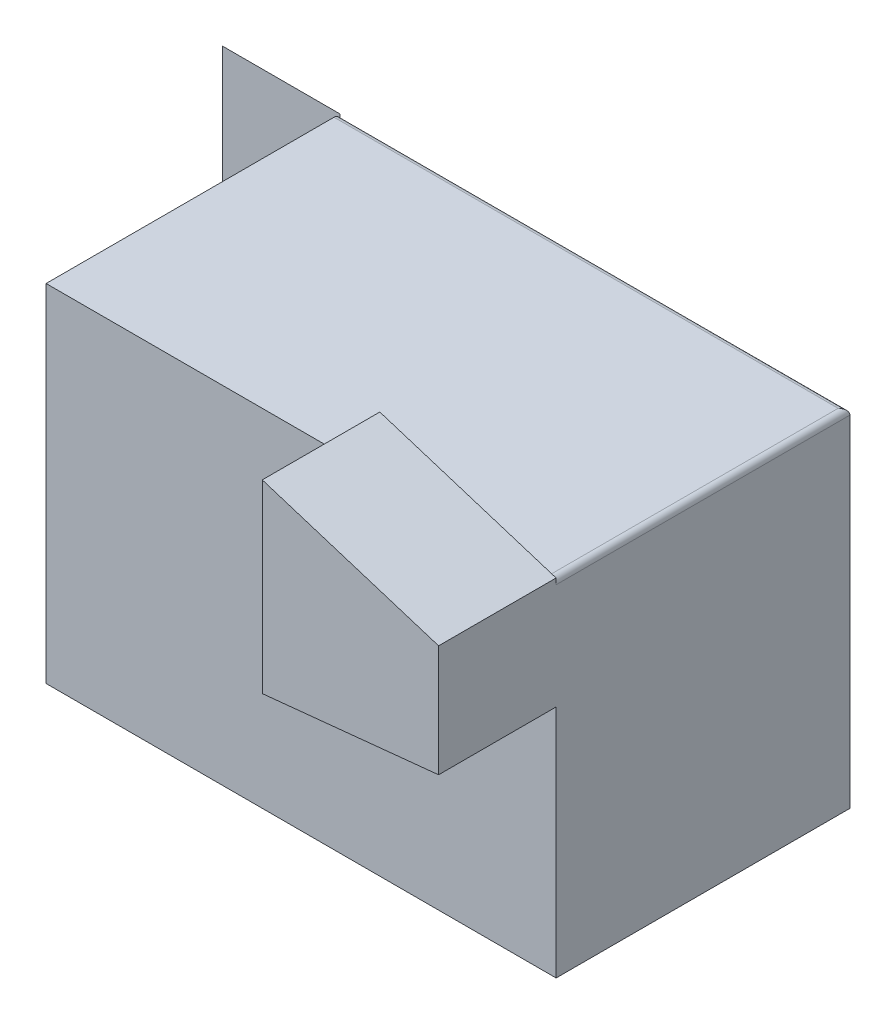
ISO-10303-21;
HEADER;
FILE_DESCRIPTION(('STEP AP214'),'2;1');
FILE_NAME('part.step','',(''),(''),'','','');
FILE_SCHEMA(('AUTOMOTIVE_DESIGN { 1 0 10303 214 1 1 1 1 }'));
ENDSEC;
DATA;
#1=APPLICATION_CONTEXT('core data for automotive mechanical design processes');
#2=APPLICATION_PROTOCOL_DEFINITION('international standard','automotive_design',2000,#1);
#3=PRODUCT_CONTEXT('',#1,'mechanical');
#4=PRODUCT('Part','Part','',(#3));
#5=PRODUCT_RELATED_PRODUCT_CATEGORY('part','',(#4));
#6=PRODUCT_DEFINITION_FORMATION('','',#4);
#7=PRODUCT_DEFINITION_CONTEXT('part definition',#1,'design');
#8=PRODUCT_DEFINITION('design','',#6,#7);
#9=PRODUCT_DEFINITION_SHAPE('','',#8);
#10=(LENGTH_UNIT() NAMED_UNIT(*) SI_UNIT(.MILLI.,.METRE.));
#11=(NAMED_UNIT(*) PLANE_ANGLE_UNIT() SI_UNIT($,.RADIAN.));
#12=(NAMED_UNIT(*) SI_UNIT($,.STERADIAN.) SOLID_ANGLE_UNIT());
#13=UNCERTAINTY_MEASURE_WITH_UNIT(LENGTH_MEASURE(1.E-05),#10,'distance_accuracy_value','');
#14=(GEOMETRIC_REPRESENTATION_CONTEXT(3) GLOBAL_UNCERTAINTY_ASSIGNED_CONTEXT((#13)) GLOBAL_UNIT_ASSIGNED_CONTEXT((#10,
#11,#12)) REPRESENTATION_CONTEXT('',''));
#15=CARTESIAN_POINT('',(0.,0.,0.));
#16=DIRECTION('',(0.,0.,1.));
#17=DIRECTION('',(1.,0.,0.));
#18=AXIS2_PLACEMENT_3D('',#15,#16,#17);
#19=CARTESIAN_POINT('',(-45.0381008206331,29.1519343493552,-25.));
#20=DIRECTION('',(0.,0.,-1.));
#21=DIRECTION('',(-1.,0.,0.));
#22=AXIS2_PLACEMENT_3D('',#19,#20,#21);
#23=PLANE('',#22);
#24=DIRECTION('',(0.,-1.,0.));
#25=VECTOR('',#24,1.);
#26=CARTESIAN_POINT('',(-65.0381008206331,29.1519343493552,-25.));
#27=LINE('',#26,#25);
#28=CARTESIAN_POINT('',(-65.0381008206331,29.1519343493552,-25.));
#29=VERTEX_POINT('',#28);
#30=CARTESIAN_POINT('',(-65.0381008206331,-29.8070339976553,-25.));
#31=VERTEX_POINT('',#30);
#32=EDGE_CURVE('E63',#29,#31,#27,.T.);
#33=ORIENTED_EDGE('',*,*,#32,.F.);
#34=DIRECTION('',(-1.,0.,0.));
#35=VECTOR('',#34,1.);
#36=CARTESIAN_POINT('',(-45.0381008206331,29.1519343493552,-25.));
#37=LINE('',#36,#35);
#38=CARTESIAN_POINT('',(-45.0381008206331,29.1519343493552,-25.));
#39=VERTEX_POINT('',#38);
#40=EDGE_CURVE('E44',#39,#29,#37,.T.);
#41=ORIENTED_EDGE('',*,*,#40,.F.);
#42=DIRECTION('',(0.,-1.,0.));
#43=VECTOR('',#42,1.);
#44=CARTESIAN_POINT('',(-45.0381008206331,29.1519343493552,-25.));
#45=LINE('',#44,#43);
#46=CARTESIAN_POINT('',(-45.0381008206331,-29.8070339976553,-25.));
#47=VERTEX_POINT('',#46);
#48=EDGE_CURVE('E49',#39,#47,#45,.T.);
#49=ORIENTED_EDGE('',*,*,#48,.T.);
#50=DIRECTION('',(-1.,0.,0.));
#51=VECTOR('',#50,1.);
#52=CARTESIAN_POINT('',(-45.0381008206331,-29.8070339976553,-25.));
#53=LINE('',#52,#51);
#54=EDGE_CURVE('E12',#47,#31,#53,.T.);
#55=ORIENTED_EDGE('',*,*,#54,.T.);
#56=EDGE_LOOP('',(#33,#41,#49,#55));
#57=FACE_BOUND('',#56,.T.);
#58=ADVANCED_FACE('F43',(#57),#23,.T.);
#59=OPEN_SHELL('',(#58));
#60=SHELL_BASED_SURFACE_MODEL('B2',(#59));
#61=CARTESIAN_POINT('',(41.7626025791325,-29.8070339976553,25.));
#62=DIRECTION('',(0.,0.,-1.));
#63=DIRECTION('',(-1.,0.,0.));
#64=AXIS2_PLACEMENT_3D('',#61,#62,#63);
#65=PLANE('',#64);
#66=DIRECTION('',(0.994909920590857,0.100768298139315,0.));
#67=VECTOR('',#66,1.);
#68=CARTESIAN_POINT('',(11.7556692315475,7.10366905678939,25.));
#69=LINE('',#68,#67);
#70=CARTESIAN_POINT('',(11.7556692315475,7.10366905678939,25.));
#71=VERTEX_POINT('',#70);
#72=CARTESIAN_POINT('',(41.7626025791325,10.1428865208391,25.));
#73=VERTEX_POINT('',#72);
#74=EDGE_CURVE('E173',#71,#73,#69,.T.);
#75=ORIENTED_EDGE('',*,*,#74,.F.);
#76=DIRECTION('',(0.,-1.,0.));
#77=VECTOR('',#76,1.);
#78=CARTESIAN_POINT('',(11.7556692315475,38.6041996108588,25.));
#79=LINE('',#78,#77);
#80=CARTESIAN_POINT('',(11.7556692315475,29.1519343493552,25.));
#81=VERTEX_POINT('',#80);
#82=EDGE_CURVE('E175',#81,#71,#79,.T.);
#83=ORIENTED_EDGE('',*,*,#82,.F.);
#84=DIRECTION('',(-1.,0.,0.));
#85=VECTOR('',#84,1.);
#86=CARTESIAN_POINT('',(41.7626025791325,29.1519343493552,25.));
#87=LINE('',#86,#85);
#88=CARTESIAN_POINT('',(-45.0381008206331,29.1519343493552,25.));
#89=VERTEX_POINT('',#88);
#90=EDGE_CURVE('E257',#81,#89,#87,.T.);
#91=ORIENTED_EDGE('',*,*,#90,.T.);
#92=DIRECTION('',(0.,-1.,0.));
#93=VECTOR('',#92,1.);
#94=CARTESIAN_POINT('',(-45.0381008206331,29.1519343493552,25.));
#95=LINE('',#94,#93);
#96=CARTESIAN_POINT('',(-45.0381008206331,-29.8070339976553,25.));
#97=VERTEX_POINT('',#96);
#98=EDGE_CURVE('E248',#89,#97,#95,.T.);
#99=ORIENTED_EDGE('',*,*,#98,.T.);
#100=DIRECTION('',(1.,0.,0.));
#101=VECTOR('',#100,1.);
#102=CARTESIAN_POINT('',(41.7626025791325,-29.8070339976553,25.));
#103=LINE('',#102,#101);
#104=CARTESIAN_POINT('',(41.7626025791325,-29.8070339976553,25.));
#105=VERTEX_POINT('',#104);
#106=EDGE_CURVE('E254',#97,#105,#103,.T.);
#107=ORIENTED_EDGE('',*,*,#106,.T.);
#108=DIRECTION('',(0.,1.,0.));
#109=VECTOR('',#108,1.);
#110=CARTESIAN_POINT('',(41.7626025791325,29.1519343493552,25.));
#111=LINE('',#110,#109);
#112=EDGE_CURVE('E201',#105,#73,#111,.T.);
#113=ORIENTED_EDGE('',*,*,#112,.T.);
#114=EDGE_LOOP('',(#75,#83,#91,#99,#107,#113));
#115=FACE_BOUND('',#114,.T.);
#116=ADVANCED_FACE('F87',(#115),#65,.F.);
#117=CARTESIAN_POINT('',(41.7626025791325,29.1519343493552,25.));
#118=DIRECTION('',(-1.,0.,0.));
#119=DIRECTION('',(0.,0.,1.));
#120=AXIS2_PLACEMENT_3D('',#117,#118,#119);
#121=PLANE('',#120);
#122=DIRECTION('',(0.,1.,0.));
#123=VECTOR('',#122,1.);
#124=CARTESIAN_POINT('',(41.7626025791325,29.1519343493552,-25.));
#125=LINE('',#124,#123);
#126=CARTESIAN_POINT('',(41.7626025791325,-29.8070339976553,-25.));
#127=VERTEX_POINT('',#126);
#128=CARTESIAN_POINT('',(41.7626025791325,28.1519343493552,-25.));
#129=VERTEX_POINT('',#128);
#130=EDGE_CURVE('E184',#127,#129,#125,.T.);
#131=ORIENTED_EDGE('',*,*,#130,.T.);
#132=DIRECTION('',(0.,0.,-1.));
#133=VECTOR('',#132,1.);
#134=CARTESIAN_POINT('',(41.7626025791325,28.1519343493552,25.));
#135=LINE('',#134,#133);
#136=CARTESIAN_POINT('',(41.7626025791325,28.1519343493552,25.));
#137=VERTEX_POINT('',#136);
#138=EDGE_CURVE('E214',#129,#137,#135,.F.);
#139=ORIENTED_EDGE('',*,*,#138,.T.);
#140=DIRECTION('',(0.,1.,0.));
#141=VECTOR('',#140,1.);
#142=CARTESIAN_POINT('',(41.7626025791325,29.1519343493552,25.));
#143=LINE('',#142,#141);
#144=CARTESIAN_POINT('',(41.7626025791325,29.1519343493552,25.));
#145=VERTEX_POINT('',#144);
#146=EDGE_CURVE('E212',#137,#145,#143,.T.);
#147=ORIENTED_EDGE('',*,*,#146,.T.);
#148=DIRECTION('',(0.,0.,-1.));
#149=VECTOR('',#148,1.);
#150=CARTESIAN_POINT('',(41.7626025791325,29.1519343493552,45.));
#151=LINE('',#150,#149);
#152=CARTESIAN_POINT('',(41.7626025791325,29.1519343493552,45.));
#153=VERTEX_POINT('',#152);
#154=EDGE_CURVE('E190',#153,#145,#151,.T.);
#155=ORIENTED_EDGE('',*,*,#154,.F.);
#156=DIRECTION('',(0.,1.,0.));
#157=VECTOR('',#156,1.);
#158=CARTESIAN_POINT('',(41.7626025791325,29.1519343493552,45.));
#159=LINE('',#158,#157);
#160=CARTESIAN_POINT('',(41.7626025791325,10.1428865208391,45.));
#161=VERTEX_POINT('',#160);
#162=EDGE_CURVE('E266',#161,#153,#159,.T.);
#163=ORIENTED_EDGE('',*,*,#162,.F.);
#164=DIRECTION('',(0.,0.,-1.));
#165=VECTOR('',#164,1.);
#166=CARTESIAN_POINT('',(41.7626025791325,10.1428865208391,45.));
#167=LINE('',#166,#165);
#168=EDGE_CURVE('E204',#161,#73,#167,.T.);
#169=ORIENTED_EDGE('',*,*,#168,.T.);
#170=ORIENTED_EDGE('',*,*,#112,.F.);
#171=DIRECTION('',(0.,0.,-1.));
#172=VECTOR('',#171,1.);
#173=CARTESIAN_POINT('',(41.7626025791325,-29.8070339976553,25.));
#174=LINE('',#173,#172);
#175=EDGE_CURVE('E234',#105,#127,#174,.T.);
#176=ORIENTED_EDGE('',*,*,#175,.T.);
#177=EDGE_LOOP('',(#131,#139,#147,#155,#163,#169,#170,#176));
#178=FACE_BOUND('',#177,.T.);
#179=ADVANCED_FACE('F89',(#178),#121,.F.);
#180=CARTESIAN_POINT('',(41.7626025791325,29.1519343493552,25.));
#181=DIRECTION('',(0.,-1.,0.));
#182=DIRECTION('',(0.,0.,-1.));
#183=AXIS2_PLACEMENT_3D('',#180,#181,#182);
#184=PLANE('',#183);
#185=DIRECTION('',(0.,0.,-1.));
#186=VECTOR('',#185,1.);
#187=CARTESIAN_POINT('',(40.7626025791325,29.1519343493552,25.));
#188=LINE('',#187,#186);
#189=CARTESIAN_POINT('',(40.7626025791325,29.1519343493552,25.));
#190=VERTEX_POINT('',#189);
#191=CARTESIAN_POINT('',(40.7626025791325,29.1519343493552,-24.));
#192=VERTEX_POINT('',#191);
#193=EDGE_CURVE('E209',#190,#192,#188,.T.);
#194=ORIENTED_EDGE('',*,*,#193,.T.);
#195=DIRECTION('',(-1.,0.,0.));
#196=VECTOR('',#195,1.);
#197=CARTESIAN_POINT('',(-45.0381008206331,29.1519343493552,-24.));
#198=LINE('',#197,#196);
#199=CARTESIAN_POINT('',(-45.0381008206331,29.1519343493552,-24.));
#200=VERTEX_POINT('',#199);
#201=EDGE_CURVE('E219',#192,#200,#198,.T.);
#202=ORIENTED_EDGE('',*,*,#201,.T.);
#203=DIRECTION('',(0.,0.,-1.));
#204=VECTOR('',#203,1.);
#205=CARTESIAN_POINT('',(-45.0381008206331,29.1519343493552,25.));
#206=LINE('',#205,#204);
#207=EDGE_CURVE('E244',#89,#200,#206,.T.);
#208=ORIENTED_EDGE('',*,*,#207,.F.);
#209=ORIENTED_EDGE('',*,*,#90,.F.);
#210=EDGE_CURVE('E169',#190,#81,#87,.T.);
#211=ORIENTED_EDGE('',*,*,#210,.F.);
#212=EDGE_LOOP('',(#194,#202,#208,#209,#211));
#213=FACE_BOUND('',#212,.T.);
#214=ADVANCED_FACE('F242',(#213),#184,.F.);
#215=CARTESIAN_POINT('',(-45.0381008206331,29.1519343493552,25.));
#216=DIRECTION('',(1.,0.,0.));
#217=DIRECTION('',(0.,0.,-1.));
#218=AXIS2_PLACEMENT_3D('',#215,#216,#217);
#219=PLANE('',#218);
#220=ORIENTED_EDGE('',*,*,#207,.T.);
#221=CARTESIAN_POINT('',(-45.0381008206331,28.1519343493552,-24.));
#222=DIRECTION('',(1.,0.,0.));
#223=DIRECTION('',(0.,0.,-1.));
#224=AXIS2_PLACEMENT_3D('',#221,#222,#223);
#225=CIRCLE('',#224,1.);
#226=CARTESIAN_POINT('',(-45.0381008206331,28.1519343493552,-25.));
#227=VERTEX_POINT('',#226);
#228=EDGE_CURVE('E102',#200,#227,#225,.F.);
#229=ORIENTED_EDGE('',*,*,#228,.T.);
#230=DIRECTION('',(0.,-1.,0.));
#231=VECTOR('',#230,1.);
#232=CARTESIAN_POINT('',(-45.0381008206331,29.1519343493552,-25.));
#233=LINE('',#232,#231);
#234=CARTESIAN_POINT('',(-45.0381008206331,-29.8070339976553,-25.));
#235=VERTEX_POINT('',#234);
#236=EDGE_CURVE('E226',#227,#235,#233,.T.);
#237=ORIENTED_EDGE('',*,*,#236,.T.);
#238=DIRECTION('',(0.,0.,-1.));
#239=VECTOR('',#238,1.);
#240=CARTESIAN_POINT('',(-45.0381008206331,-29.8070339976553,25.));
#241=LINE('',#240,#239);
#242=EDGE_CURVE('E249',#97,#235,#241,.T.);
#243=ORIENTED_EDGE('',*,*,#242,.F.);
#244=ORIENTED_EDGE('',*,*,#98,.F.);
#245=EDGE_LOOP('',(#220,#229,#237,#243,#244));
#246=FACE_BOUND('',#245,.T.);
#247=ADVANCED_FACE('F246',(#246),#219,.F.);
#248=CARTESIAN_POINT('',(41.7626025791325,-29.8070339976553,25.));
#249=DIRECTION('',(0.,1.,0.));
#250=DIRECTION('',(0.,0.,1.));
#251=AXIS2_PLACEMENT_3D('',#248,#249,#250);
#252=PLANE('',#251);
#253=DIRECTION('',(1.,0.,0.));
#254=VECTOR('',#253,1.);
#255=CARTESIAN_POINT('',(41.7626025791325,-29.8070339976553,-25.));
#256=LINE('',#255,#254);
#257=EDGE_CURVE('E260',#235,#127,#256,.T.);
#258=ORIENTED_EDGE('',*,*,#257,.T.);
#259=ORIENTED_EDGE('',*,*,#175,.F.);
#260=ORIENTED_EDGE('',*,*,#106,.F.);
#261=ORIENTED_EDGE('',*,*,#242,.T.);
#262=EDGE_LOOP('',(#258,#259,#260,#261));
#263=FACE_BOUND('',#262,.T.);
#264=ADVANCED_FACE('F294',(#263),#252,.F.);
#265=CARTESIAN_POINT('',(41.7626025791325,-29.8070339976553,-25.));
#266=DIRECTION('',(0.,0.,-1.));
#267=DIRECTION('',(-1.,0.,0.));
#268=AXIS2_PLACEMENT_3D('',#265,#266,#267);
#269=PLANE('',#268);
#270=ORIENTED_EDGE('',*,*,#236,.F.);
#271=DIRECTION('',(-1.,0.,0.));
#272=VECTOR('',#271,1.);
#273=CARTESIAN_POINT('',(40.7626025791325,28.1519343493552,-25.));
#274=LINE('',#273,#272);
#275=EDGE_CURVE('E95',#227,#129,#274,.F.);
#276=ORIENTED_EDGE('',*,*,#275,.T.);
#277=ORIENTED_EDGE('',*,*,#130,.F.);
#278=ORIENTED_EDGE('',*,*,#257,.F.);
#279=EDGE_LOOP('',(#270,#276,#277,#278));
#280=FACE_BOUND('',#279,.T.);
#281=ADVANCED_FACE('F224',(#280),#269,.T.);
#282=CARTESIAN_POINT('',(11.7556692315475,38.6041996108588,25.));
#283=DIRECTION('',(0.,0.,1.));
#284=DIRECTION('',(1.,0.,0.));
#285=AXIS2_PLACEMENT_3D('',#282,#283,#284);
#286=PLANE('',#285);
#287=DIRECTION('',(-0.953797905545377,0.300448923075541,0.));
#288=VECTOR('',#287,1.);
#289=CARTESIAN_POINT('',(41.7626025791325,29.1519343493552,25.));
#290=LINE('',#289,#288);
#291=CARTESIAN_POINT('',(11.7556692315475,38.6041996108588,25.));
#292=VERTEX_POINT('',#291);
#293=EDGE_CURVE('E167',#145,#292,#290,.T.);
#294=ORIENTED_EDGE('',*,*,#293,.F.);
#295=ORIENTED_EDGE('',*,*,#146,.F.);
#296=CARTESIAN_POINT('',(40.7626025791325,28.1519343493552,25.));
#297=DIRECTION('',(0.,0.,1.));
#298=DIRECTION('',(1.,0.,0.));
#299=AXIS2_PLACEMENT_3D('',#296,#297,#298);
#300=CIRCLE('',#299,1.);
#301=EDGE_CURVE('E217',#137,#190,#300,.T.);
#302=ORIENTED_EDGE('',*,*,#301,.T.);
#303=ORIENTED_EDGE('',*,*,#210,.T.);
#304=EDGE_CURVE('E163',#292,#81,#79,.T.);
#305=ORIENTED_EDGE('',*,*,#304,.F.);
#306=EDGE_LOOP('',(#294,#295,#302,#303,#305));
#307=FACE_BOUND('',#306,.T.);
#308=ADVANCED_FACE('F165',(#307),#286,.F.);
#309=CARTESIAN_POINT('',(41.7626025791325,29.1519343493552,45.));
#310=DIRECTION('',(-0.300448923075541,-0.953797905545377,0.));
#311=DIRECTION('',(0.953797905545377,-0.300448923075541,0.));
#312=AXIS2_PLACEMENT_3D('',#309,#310,#311);
#313=PLANE('',#312);
#314=ORIENTED_EDGE('',*,*,#293,.T.);
#315=DIRECTION('',(0.,0.,-1.));
#316=VECTOR('',#315,1.);
#317=CARTESIAN_POINT('',(11.7556692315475,38.6041996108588,45.));
#318=LINE('',#317,#316);
#319=CARTESIAN_POINT('',(11.7556692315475,38.6041996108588,45.));
#320=VERTEX_POINT('',#319);
#321=EDGE_CURVE('E177',#320,#292,#318,.T.);
#322=ORIENTED_EDGE('',*,*,#321,.F.);
#323=DIRECTION('',(-0.953797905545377,0.300448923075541,0.));
#324=VECTOR('',#323,1.);
#325=CARTESIAN_POINT('',(41.7626025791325,29.1519343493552,45.));
#326=LINE('',#325,#324);
#327=EDGE_CURVE('E195',#153,#320,#326,.T.);
#328=ORIENTED_EDGE('',*,*,#327,.F.);
#329=ORIENTED_EDGE('',*,*,#154,.T.);
#330=EDGE_LOOP('',(#314,#322,#328,#329));
#331=FACE_BOUND('',#330,.T.);
#332=ADVANCED_FACE('F188',(#331),#313,.F.);
#333=CARTESIAN_POINT('',(11.7556692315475,38.6041996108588,45.));
#334=DIRECTION('',(1.,0.,0.));
#335=DIRECTION('',(0.,0.,-1.));
#336=AXIS2_PLACEMENT_3D('',#333,#334,#335);
#337=PLANE('',#336);
#338=ORIENTED_EDGE('',*,*,#304,.T.);
#339=ORIENTED_EDGE('',*,*,#82,.T.);
#340=DIRECTION('',(0.,0.,-1.));
#341=VECTOR('',#340,1.);
#342=CARTESIAN_POINT('',(11.7556692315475,7.10366905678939,45.));
#343=LINE('',#342,#341);
#344=CARTESIAN_POINT('',(11.7556692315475,7.10366905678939,45.));
#345=VERTEX_POINT('',#344);
#346=EDGE_CURVE('E185',#345,#71,#343,.T.);
#347=ORIENTED_EDGE('',*,*,#346,.F.);
#348=DIRECTION('',(0.,-1.,0.));
#349=VECTOR('',#348,1.);
#350=CARTESIAN_POINT('',(11.7556692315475,38.6041996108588,45.));
#351=LINE('',#350,#349);
#352=EDGE_CURVE('E180',#320,#345,#351,.T.);
#353=ORIENTED_EDGE('',*,*,#352,.F.);
#354=ORIENTED_EDGE('',*,*,#321,.T.);
#355=EDGE_LOOP('',(#338,#339,#347,#353,#354));
#356=FACE_BOUND('',#355,.T.);
#357=ADVANCED_FACE('F178',(#356),#337,.F.);
#358=CARTESIAN_POINT('',(11.7556692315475,7.10366905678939,45.));
#359=DIRECTION('',(-0.100768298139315,0.994909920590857,0.));
#360=DIRECTION('',(-0.994909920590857,-0.100768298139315,0.));
#361=AXIS2_PLACEMENT_3D('',#358,#359,#360);
#362=PLANE('',#361);
#363=ORIENTED_EDGE('',*,*,#74,.T.);
#364=ORIENTED_EDGE('',*,*,#168,.F.);
#365=DIRECTION('',(0.994909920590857,0.100768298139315,0.));
#366=VECTOR('',#365,1.);
#367=CARTESIAN_POINT('',(11.7556692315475,7.10366905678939,45.));
#368=LINE('',#367,#366);
#369=EDGE_CURVE('E268',#345,#161,#368,.T.);
#370=ORIENTED_EDGE('',*,*,#369,.F.);
#371=ORIENTED_EDGE('',*,*,#346,.T.);
#372=EDGE_LOOP('',(#363,#364,#370,#371));
#373=FACE_BOUND('',#372,.T.);
#374=ADVANCED_FACE('F277',(#373),#362,.F.);
#375=CARTESIAN_POINT('',(11.7556692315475,38.6041996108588,45.));
#376=DIRECTION('',(0.,0.,1.));
#377=DIRECTION('',(1.,0.,0.));
#378=AXIS2_PLACEMENT_3D('',#375,#376,#377);
#379=PLANE('',#378);
#380=ORIENTED_EDGE('',*,*,#327,.T.);
#381=ORIENTED_EDGE('',*,*,#352,.T.);
#382=ORIENTED_EDGE('',*,*,#369,.T.);
#383=ORIENTED_EDGE('',*,*,#162,.T.);
#384=EDGE_LOOP('',(#380,#381,#382,#383));
#385=FACE_BOUND('',#384,.T.);
#386=ADVANCED_FACE('F270',(#385),#379,.T.);
#387=CARTESIAN_POINT('',(40.7626025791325,28.1519343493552,25.));
#388=DIRECTION('',(0.,0.,-1.));
#389=DIRECTION('',(-1.,0.,0.));
#390=AXIS2_PLACEMENT_3D('',#387,#388,#389);
#391=CYLINDRICAL_SURFACE('',#390,1.);
#392=ORIENTED_EDGE('',*,*,#138,.F.);
#393=CARTESIAN_POINT('',(40.7626025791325,28.1519343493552,-24.));
#394=DIRECTION('',(-0.707106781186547,0.,-0.707106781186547));
#395=DIRECTION('',(0.707106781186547,0.,-0.707106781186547));
#396=AXIS2_PLACEMENT_3D('',#393,#394,#395);
#397=ELLIPSE('',#396,1.41421356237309,1.);
#398=EDGE_CURVE('E41',#129,#192,#397,.F.);
#399=ORIENTED_EDGE('',*,*,#398,.T.);
#400=ORIENTED_EDGE('',*,*,#193,.F.);
#401=ORIENTED_EDGE('',*,*,#301,.F.);
#402=EDGE_LOOP('',(#392,#399,#400,#401));
#403=FACE_BOUND('',#402,.T.);
#404=ADVANCED_FACE('F237',(#403),#391,.T.);
#405=CARTESIAN_POINT('',(41.7626025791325,28.1519343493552,-24.));
#406=DIRECTION('',(1.,0.,0.));
#407=DIRECTION('',(0.,0.,-1.));
#408=AXIS2_PLACEMENT_3D('',#405,#406,#407);
#409=CYLINDRICAL_SURFACE('',#408,1.);
#410=ORIENTED_EDGE('',*,*,#398,.F.);
#411=ORIENTED_EDGE('',*,*,#275,.F.);
#412=ORIENTED_EDGE('',*,*,#228,.F.);
#413=ORIENTED_EDGE('',*,*,#201,.F.);
#414=EDGE_LOOP('',(#410,#411,#412,#413));
#415=FACE_BOUND('',#414,.T.);
#416=ADVANCED_FACE('F239',(#415),#409,.T.);
#417=CLOSED_SHELL('',(#116,#179,#214,#247,#264,#281,#308,#332,#357,#374,#386,#404,#416));
#418=MANIFOLD_SOLID_BREP('B6',#417);
#419=ADVANCED_BREP_SHAPE_REPRESENTATION('',(#18,#418),#14);
#420=MANIFOLD_SURFACE_SHAPE_REPRESENTATION('',(#18,#60),#14);
#421=SHAPE_REPRESENTATION('',(#18),#14);
#422=SHAPE_DEFINITION_REPRESENTATION(#9,#421);
#423=SHAPE_REPRESENTATION_RELATIONSHIP('','',#421,#419);
#424=SHAPE_REPRESENTATION_RELATIONSHIP('','',#421,#420);
ENDSEC;
END-ISO-10303-21;
